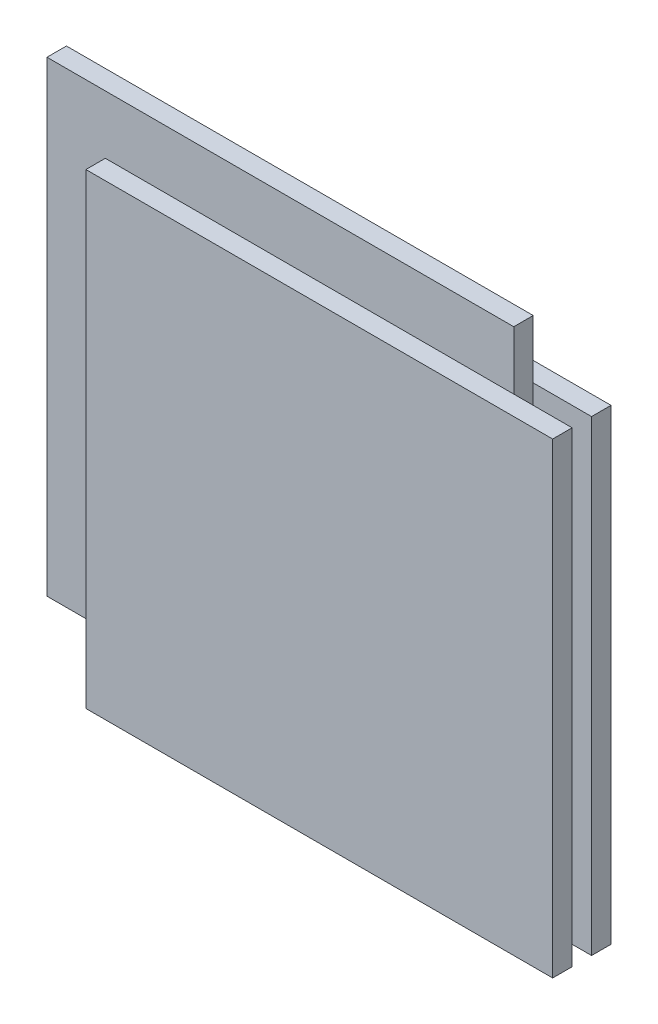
from build123d import *

# Parameters (mm, degrees)
SKETCH1_W           = 120
SKETCH1_H           = 120
BOSS_EXTRUDE1_DEPTH = 2.5
SKETCH2_W           = 120
SKETCH2_H           = 120
BOSS_EXTRUDE2_DEPTH = 5
SKETCH3_W           = 120
SKETCH3_H           = 120
BOSS_EXTRUDE3_DEPTH = 5


with BuildPart() as part:
    # Sketch1 → Boss-Extrude1 (new, symmetric)
    with BuildSketch(Plane.XY):
        Rectangle(SKETCH1_W, SKETCH1_H)
    extrude(amount=BOSS_EXTRUDE1_DEPTH, both=True)

    # Sketch2 → Boss-Extrude2 (add)
    with BuildSketch(Plane.XY.offset(2.5)):
        with Locations((15, -15)):
            Rectangle(SKETCH2_W, SKETCH2_H)
    extrude(amount=BOSS_EXTRUDE2_DEPTH)

    # Sketch3 → Boss-Extrude3 (add)
    with BuildSketch(Plane(origin=(0, 0, -2.5), x_dir=(-1, 0, 0), z_dir=(0, 0, -1))):
        with Locations((-15, -15)):
            Rectangle(SKETCH3_W, SKETCH3_H)
    extrude(amount=BOSS_EXTRUDE3_DEPTH)


solid = part.part
